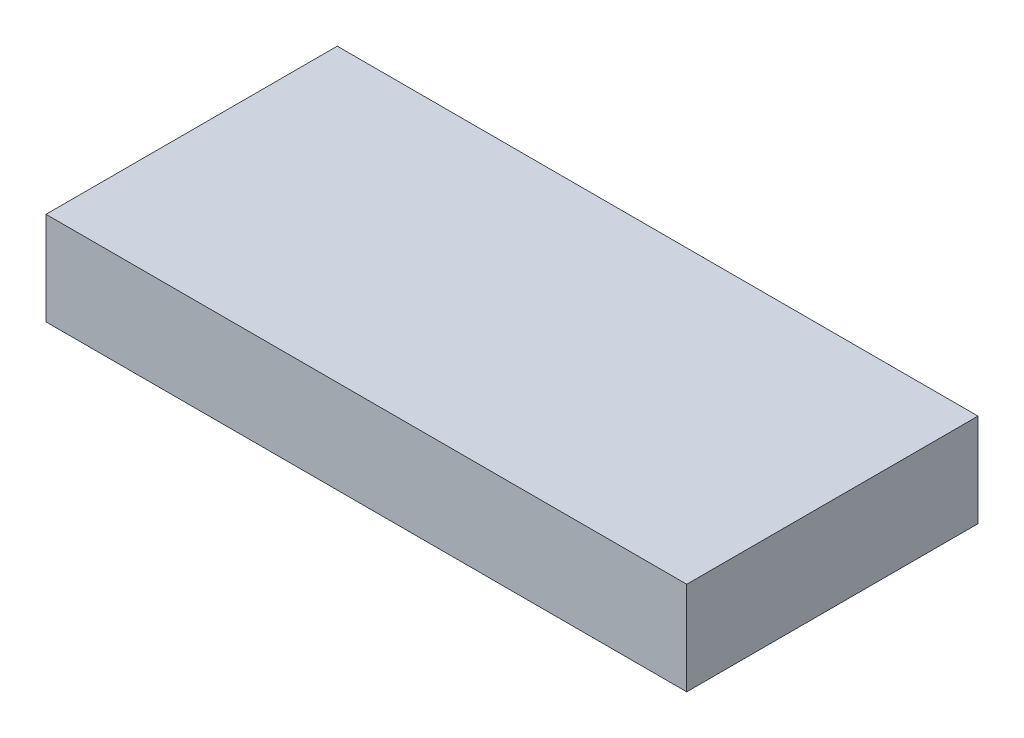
ISO-10303-21;
HEADER;
FILE_DESCRIPTION(('STEP AP214'),'2;1');
FILE_NAME('part.step','',(''),(''),'','','');
FILE_SCHEMA(('AUTOMOTIVE_DESIGN { 1 0 10303 214 1 1 1 1 }'));
ENDSEC;
DATA;
#1=APPLICATION_CONTEXT('core data for automotive mechanical design processes');
#2=APPLICATION_PROTOCOL_DEFINITION('international standard','automotive_design',2000,#1);
#3=PRODUCT_CONTEXT('',#1,'mechanical');
#4=PRODUCT('Part','Part','',(#3));
#5=PRODUCT_RELATED_PRODUCT_CATEGORY('part','',(#4));
#6=PRODUCT_DEFINITION_FORMATION('','',#4);
#7=PRODUCT_DEFINITION_CONTEXT('part definition',#1,'design');
#8=PRODUCT_DEFINITION('design','',#6,#7);
#9=PRODUCT_DEFINITION_SHAPE('','',#8);
#10=(LENGTH_UNIT() NAMED_UNIT(*) SI_UNIT(.MILLI.,.METRE.));
#11=(NAMED_UNIT(*) PLANE_ANGLE_UNIT() SI_UNIT($,.RADIAN.));
#12=(NAMED_UNIT(*) SI_UNIT($,.STERADIAN.) SOLID_ANGLE_UNIT());
#13=UNCERTAINTY_MEASURE_WITH_UNIT(LENGTH_MEASURE(1.E-05),#10,'distance_accuracy_value','');
#14=(GEOMETRIC_REPRESENTATION_CONTEXT(3) GLOBAL_UNCERTAINTY_ASSIGNED_CONTEXT((#13)) GLOBAL_UNIT_ASSIGNED_CONTEXT((#10,
#11,#12)) REPRESENTATION_CONTEXT('',''));
#15=CARTESIAN_POINT('',(0.,0.,0.));
#16=DIRECTION('',(0.,0.,1.));
#17=DIRECTION('',(1.,0.,0.));
#18=AXIS2_PLACEMENT_3D('',#15,#16,#17);
#19=CARTESIAN_POINT('',(0.,16.,0.));
#20=DIRECTION('',(-1.,0.,0.));
#21=DIRECTION('',(0.,0.,1.));
#22=AXIS2_PLACEMENT_3D('',#19,#20,#21);
#23=PLANE('',#22);
#24=DIRECTION('',(0.,0.,-1.));
#25=VECTOR('',#24,1.);
#26=CARTESIAN_POINT('',(0.,0.,0.));
#27=LINE('',#26,#25);
#28=CARTESIAN_POINT('',(0.,0.,0.));
#29=VERTEX_POINT('',#28);
#30=CARTESIAN_POINT('',(0.,0.,-50.));
#31=VERTEX_POINT('',#30);
#32=EDGE_CURVE('E113',#29,#31,#27,.T.);
#33=ORIENTED_EDGE('',*,*,#32,.T.);
#34=DIRECTION('',(0.,-1.,0.));
#35=VECTOR('',#34,1.);
#36=CARTESIAN_POINT('',(0.,16.,-50.));
#37=LINE('',#36,#35);
#38=CARTESIAN_POINT('',(0.,16.,-50.));
#39=VERTEX_POINT('',#38);
#40=EDGE_CURVE('E11',#39,#31,#37,.T.);
#41=ORIENTED_EDGE('',*,*,#40,.F.);
#42=DIRECTION('',(0.,0.,-1.));
#43=VECTOR('',#42,1.);
#44=CARTESIAN_POINT('',(0.,16.,0.));
#45=LINE('',#44,#43);
#46=CARTESIAN_POINT('',(0.,16.,0.));
#47=VERTEX_POINT('',#46);
#48=EDGE_CURVE('E97',#47,#39,#45,.T.);
#49=ORIENTED_EDGE('',*,*,#48,.F.);
#50=DIRECTION('',(0.,-1.,0.));
#51=VECTOR('',#50,1.);
#52=CARTESIAN_POINT('',(0.,16.,0.));
#53=LINE('',#52,#51);
#54=EDGE_CURVE('E109',#47,#29,#53,.T.);
#55=ORIENTED_EDGE('',*,*,#54,.T.);
#56=EDGE_LOOP('',(#33,#41,#49,#55));
#57=FACE_BOUND('',#56,.T.);
#58=ADVANCED_FACE('F45',(#57),#23,.F.);
#59=CARTESIAN_POINT('',(0.,16.,-50.));
#60=DIRECTION('',(0.,0.,1.));
#61=DIRECTION('',(1.,0.,0.));
#62=AXIS2_PLACEMENT_3D('',#59,#60,#61);
#63=PLANE('',#62);
#64=DIRECTION('',(-1.,0.,0.));
#65=VECTOR('',#64,1.);
#66=CARTESIAN_POINT('',(0.,0.,-50.));
#67=LINE('',#66,#65);
#68=CARTESIAN_POINT('',(-110.,0.,-50.));
#69=VERTEX_POINT('',#68);
#70=EDGE_CURVE('E102',#31,#69,#67,.T.);
#71=ORIENTED_EDGE('',*,*,#70,.T.);
#72=DIRECTION('',(0.,-1.,0.));
#73=VECTOR('',#72,1.);
#74=CARTESIAN_POINT('',(-110.,16.,-50.));
#75=LINE('',#74,#73);
#76=CARTESIAN_POINT('',(-110.,16.,-50.));
#77=VERTEX_POINT('',#76);
#78=EDGE_CURVE('E54',#77,#69,#75,.T.);
#79=ORIENTED_EDGE('',*,*,#78,.F.);
#80=DIRECTION('',(-1.,0.,0.));
#81=VECTOR('',#80,1.);
#82=CARTESIAN_POINT('',(0.,16.,-50.));
#83=LINE('',#82,#81);
#84=EDGE_CURVE('E92',#39,#77,#83,.T.);
#85=ORIENTED_EDGE('',*,*,#84,.F.);
#86=ORIENTED_EDGE('',*,*,#40,.T.);
#87=EDGE_LOOP('',(#71,#79,#85,#86));
#88=FACE_BOUND('',#87,.T.);
#89=ADVANCED_FACE('F101',(#88),#63,.F.);
#90=CARTESIAN_POINT('',(-110.,16.,0.));
#91=DIRECTION('',(1.,0.,0.));
#92=DIRECTION('',(0.,0.,-1.));
#93=AXIS2_PLACEMENT_3D('',#90,#91,#92);
#94=PLANE('',#93);
#95=DIRECTION('',(0.,0.,1.));
#96=VECTOR('',#95,1.);
#97=CARTESIAN_POINT('',(-110.,0.,0.));
#98=LINE('',#97,#96);
#99=CARTESIAN_POINT('',(-110.,0.,0.));
#100=VERTEX_POINT('',#99);
#101=EDGE_CURVE('E79',#69,#100,#98,.T.);
#102=ORIENTED_EDGE('',*,*,#101,.T.);
#103=DIRECTION('',(0.,-1.,0.));
#104=VECTOR('',#103,1.);
#105=CARTESIAN_POINT('',(-110.,16.,0.));
#106=LINE('',#105,#104);
#107=CARTESIAN_POINT('',(-110.,16.,0.));
#108=VERTEX_POINT('',#107);
#109=EDGE_CURVE('E104',#108,#100,#106,.T.);
#110=ORIENTED_EDGE('',*,*,#109,.F.);
#111=DIRECTION('',(0.,0.,1.));
#112=VECTOR('',#111,1.);
#113=CARTESIAN_POINT('',(-110.,16.,0.));
#114=LINE('',#113,#112);
#115=EDGE_CURVE('E95',#77,#108,#114,.T.);
#116=ORIENTED_EDGE('',*,*,#115,.F.);
#117=ORIENTED_EDGE('',*,*,#78,.T.);
#118=EDGE_LOOP('',(#102,#110,#116,#117));
#119=FACE_BOUND('',#118,.T.);
#120=ADVANCED_FACE('F105',(#119),#94,.F.);
#121=CARTESIAN_POINT('',(0.,16.,0.));
#122=DIRECTION('',(0.,0.,-1.));
#123=DIRECTION('',(-1.,0.,0.));
#124=AXIS2_PLACEMENT_3D('',#121,#122,#123);
#125=PLANE('',#124);
#126=DIRECTION('',(1.,0.,0.));
#127=VECTOR('',#126,1.);
#128=CARTESIAN_POINT('',(0.,0.,0.));
#129=LINE('',#128,#127);
#130=EDGE_CURVE('E85',#100,#29,#129,.T.);
#131=ORIENTED_EDGE('',*,*,#130,.T.);
#132=ORIENTED_EDGE('',*,*,#54,.F.);
#133=DIRECTION('',(1.,0.,0.));
#134=VECTOR('',#133,1.);
#135=CARTESIAN_POINT('',(0.,16.,0.));
#136=LINE('',#135,#134);
#137=EDGE_CURVE('E62',#108,#47,#136,.T.);
#138=ORIENTED_EDGE('',*,*,#137,.F.);
#139=ORIENTED_EDGE('',*,*,#109,.T.);
#140=EDGE_LOOP('',(#131,#132,#138,#139));
#141=FACE_BOUND('',#140,.T.);
#142=ADVANCED_FACE('F126',(#141),#125,.F.);
#143=CARTESIAN_POINT('',(0.,16.,0.));
#144=DIRECTION('',(0.,1.,0.));
#145=DIRECTION('',(0.,0.,1.));
#146=AXIS2_PLACEMENT_3D('',#143,#144,#145);
#147=PLANE('',#146);
#148=ORIENTED_EDGE('',*,*,#48,.T.);
#149=ORIENTED_EDGE('',*,*,#84,.T.);
#150=ORIENTED_EDGE('',*,*,#115,.T.);
#151=ORIENTED_EDGE('',*,*,#137,.T.);
#152=EDGE_LOOP('',(#148,#149,#150,#151));
#153=FACE_BOUND('',#152,.T.);
#154=ADVANCED_FACE('F93',(#153),#147,.T.);
#155=CARTESIAN_POINT('',(0.,0.,0.));
#156=DIRECTION('',(0.,1.,0.));
#157=DIRECTION('',(0.,0.,1.));
#158=AXIS2_PLACEMENT_3D('',#155,#156,#157);
#159=PLANE('',#158);
#160=ORIENTED_EDGE('',*,*,#32,.F.);
#161=ORIENTED_EDGE('',*,*,#130,.F.);
#162=ORIENTED_EDGE('',*,*,#101,.F.);
#163=ORIENTED_EDGE('',*,*,#70,.F.);
#164=EDGE_LOOP('',(#160,#161,#162,#163));
#165=FACE_BOUND('',#164,.T.);
#166=ADVANCED_FACE('F129',(#165),#159,.F.);
#167=CLOSED_SHELL('',(#58,#89,#120,#142,#154,#166));
#168=MANIFOLD_SOLID_BREP('B2',#167);
#169=ADVANCED_BREP_SHAPE_REPRESENTATION('',(#18,#168),#14);
#170=SHAPE_DEFINITION_REPRESENTATION(#9,#169);
ENDSEC;
END-ISO-10303-21;
